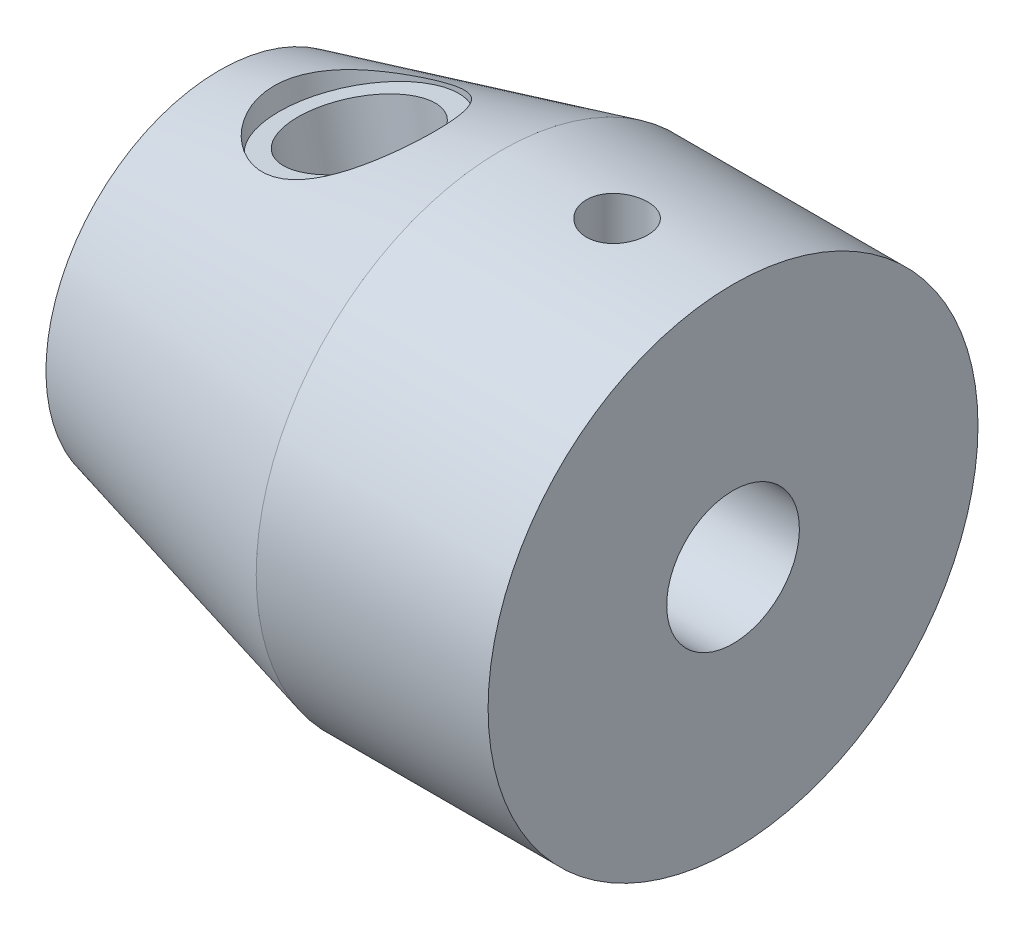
ISO-10303-21;
HEADER;
FILE_DESCRIPTION(('STEP AP214'),'2;1');
FILE_NAME('part.step','',(''),(''),'','','');
FILE_SCHEMA(('AUTOMOTIVE_DESIGN { 1 0 10303 214 1 1 1 1 }'));
ENDSEC;
DATA;
#1=APPLICATION_CONTEXT('core data for automotive mechanical design processes');
#2=APPLICATION_PROTOCOL_DEFINITION('international standard','automotive_design',2000,#1);
#3=PRODUCT_CONTEXT('',#1,'mechanical');
#4=PRODUCT('Part','Part','',(#3));
#5=PRODUCT_RELATED_PRODUCT_CATEGORY('part','',(#4));
#6=PRODUCT_DEFINITION_FORMATION('','',#4);
#7=PRODUCT_DEFINITION_CONTEXT('part definition',#1,'design');
#8=PRODUCT_DEFINITION('design','',#6,#7);
#9=PRODUCT_DEFINITION_SHAPE('','',#8);
#10=(LENGTH_UNIT() NAMED_UNIT(*) SI_UNIT(.MILLI.,.METRE.));
#11=(NAMED_UNIT(*) PLANE_ANGLE_UNIT() SI_UNIT($,.RADIAN.));
#12=(NAMED_UNIT(*) SI_UNIT($,.STERADIAN.) SOLID_ANGLE_UNIT());
#13=UNCERTAINTY_MEASURE_WITH_UNIT(LENGTH_MEASURE(1.E-05),#10,'distance_accuracy_value','');
#14=(GEOMETRIC_REPRESENTATION_CONTEXT(3) GLOBAL_UNCERTAINTY_ASSIGNED_CONTEXT((#13)) GLOBAL_UNIT_ASSIGNED_CONTEXT((#10,
#11,#12)) REPRESENTATION_CONTEXT('',''));
#15=CARTESIAN_POINT('',(0.,0.,0.));
#16=DIRECTION('',(0.,0.,1.));
#17=DIRECTION('',(1.,0.,0.));
#18=AXIS2_PLACEMENT_3D('',#15,#16,#17);
#19=CARTESIAN_POINT('',(0.,0.,0.));
#20=DIRECTION('',(-1.,0.,0.));
#21=DIRECTION('',(0.,-1.,0.));
#22=AXIS2_PLACEMENT_3D('',#19,#20,#21);
#23=PLANE('',#22);
#24=CARTESIAN_POINT('',(0.,0.,0.));
#25=DIRECTION('',(1.,0.,0.));
#26=DIRECTION('',(0.,1.,0.));
#27=AXIS2_PLACEMENT_3D('',#24,#25,#26);
#28=CIRCLE('',#27,8.5);
#29=CARTESIAN_POINT('',(0.,8.5,0.));
#30=VERTEX_POINT('',#29);
#31=EDGE_CURVE('E45',#30,#30,#28,.T.);
#32=ORIENTED_EDGE('',*,*,#31,.F.);
#33=EDGE_LOOP('',(#32));
#34=FACE_BOUND('',#33,.T.);
#35=ADVANCED_FACE('F34',(#34),#23,.T.);
#36=CARTESIAN_POINT('',(13.8,0.,0.));
#37=DIRECTION('',(1.,0.,0.));
#38=DIRECTION('',(0.,1.,0.));
#39=AXIS2_PLACEMENT_3D('',#36,#37,#38);
#40=CONICAL_SURFACE('',#39,12.,0.24838580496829);
#41=CARTESIAN_POINT('',(3.87981151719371,9.05597758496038,-2.81704079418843));
#42=CARTESIAN_POINT('',(3.71724085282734,9.06299686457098,-2.65565465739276));
#43=CARTESIAN_POINT('',(3.56742265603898,9.07344776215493,-2.48110509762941));
#44=CARTESIAN_POINT('',(3.29821789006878,9.09690122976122,-2.10955991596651));
#45=CARTESIAN_POINT('',(3.17890691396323,9.10990999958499,-1.91251025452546));
#46=CARTESIAN_POINT('',(2.9753832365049,9.13450488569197,-1.50029593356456));
#47=CARTESIAN_POINT('',(2.89124475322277,9.14608795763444,-1.28509410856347));
#48=CARTESIAN_POINT('',(2.76258006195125,9.16458809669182,-0.843127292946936));
#49=CARTESIAN_POINT('',(2.71800909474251,9.1715104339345,-0.6163756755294));
#50=CARTESIAN_POINT('',(2.67208854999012,9.17866377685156,-0.170976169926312));
#51=CARTESIAN_POINT('',(2.66850963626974,9.17923985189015,0.0474371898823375));
#52=CARTESIAN_POINT('',(2.69899754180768,9.17446270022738,0.48155440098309));
#53=CARTESIAN_POINT('',(2.73306542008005,9.16910930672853,0.697258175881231));
#54=CARTESIAN_POINT('',(2.83540883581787,9.15400716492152,1.11272009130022));
#55=CARTESIAN_POINT('',(2.90254169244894,9.14440626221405,1.31276835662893));
#56=CARTESIAN_POINT('',(3.0675919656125,9.12305271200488,1.69957684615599));
#57=CARTESIAN_POINT('',(3.16551634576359,9.11129957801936,1.88633405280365));
#58=CARTESIAN_POINT('',(3.39509182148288,9.08787088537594,2.25278362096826));
#59=CARTESIAN_POINT('',(3.52833688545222,9.07623729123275,2.43147938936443));
#60=CARTESIAN_POINT('',(3.82121317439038,9.05761595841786,2.76606600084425));
#61=CARTESIAN_POINT('',(3.98085716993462,9.05063047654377,2.92194573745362));
#62=CARTESIAN_POINT('',(4.33325650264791,9.04516785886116,3.21668173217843));
#63=CARTESIAN_POINT('',(4.52747139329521,9.04725968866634,3.35382642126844));
#64=CARTESIAN_POINT('',(4.83300015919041,9.06106732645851,3.53418062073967));
#65=CARTESIAN_POINT('',(4.93726149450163,9.06745352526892,3.59009120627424));
#66=CARTESIAN_POINT('',(5.14976288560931,9.08423287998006,3.69300621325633));
#67=CARTESIAN_POINT('',(5.25800099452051,9.0946240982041,3.74001492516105));
#68=CARTESIAN_POINT('',(5.47437621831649,9.11940288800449,3.82343047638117));
#69=CARTESIAN_POINT('',(5.58242399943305,9.13366491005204,3.86010680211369));
#70=CARTESIAN_POINT('',(5.80053438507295,9.16649421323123,3.92425168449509));
#71=CARTESIAN_POINT('',(5.91059606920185,9.18505957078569,3.9517243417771));
#72=CARTESIAN_POINT('',(6.13182695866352,9.22655059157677,3.99717884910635));
#73=CARTESIAN_POINT('',(6.24299590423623,9.24947525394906,4.01516287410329));
#74=CARTESIAN_POINT('',(6.46551326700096,9.29958502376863,4.04145387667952));
#75=CARTESIAN_POINT('',(6.57686167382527,9.3267698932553,4.04976139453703));
#76=CARTESIAN_POINT('',(6.79077523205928,9.38303220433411,4.05637092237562));
#77=CARTESIAN_POINT('',(6.89339306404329,9.41183047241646,4.05535326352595));
#78=CARTESIAN_POINT('',(7.09728088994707,9.47255442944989,4.04496020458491));
#79=CARTESIAN_POINT('',(7.19855042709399,9.50448114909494,4.03558204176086));
#80=CARTESIAN_POINT('',(7.49926138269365,9.60435828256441,3.99503258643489));
#81=CARTESIAN_POINT('',(7.69580218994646,9.67645819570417,3.95145210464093));
#82=CARTESIAN_POINT('',(8.07745386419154,9.82816525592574,3.83244987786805));
#83=CARTESIAN_POINT('',(8.26247452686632,9.90782167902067,3.75680613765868));
#84=CARTESIAN_POINT('',(8.6162434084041,10.0697667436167,3.57598784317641));
#85=CARTESIAN_POINT('',(8.78498680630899,10.1520561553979,3.47080457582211));
#86=CARTESIAN_POINT('',(9.11410597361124,10.3202368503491,3.22551861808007));
#87=CARTESIAN_POINT('',(9.27315312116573,10.4059975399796,3.08354145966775));
#88=CARTESIAN_POINT('',(9.56658575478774,10.5701342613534,2.77236637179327));
#89=CARTESIAN_POINT('',(9.70096510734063,10.6485084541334,2.60316169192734));
#90=CARTESIAN_POINT('',(9.94599575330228,10.7952035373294,2.2358705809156));
#91=CARTESIAN_POINT('',(10.0557888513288,10.863140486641,2.03705516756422));
#92=CARTESIAN_POINT('',(10.2432472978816,10.9811720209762,1.61992196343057));
#93=CARTESIAN_POINT('',(10.3209215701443,11.0312715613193,1.40160961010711));
#94=CARTESIAN_POINT('',(10.4394226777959,11.1084046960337,0.960296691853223));
#95=CARTESIAN_POINT('',(10.4815177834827,11.1362301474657,0.737776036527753));
#96=CARTESIAN_POINT('',(10.5322067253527,11.1697945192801,0.287339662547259));
#97=CARTESIAN_POINT('',(10.540811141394,11.1755404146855,0.0594256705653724));
#98=CARTESIAN_POINT('',(10.5246236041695,11.164786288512,-0.384048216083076));
#99=CARTESIAN_POINT('',(10.5013603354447,11.149304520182,-0.59969129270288));
#100=CARTESIAN_POINT('',(10.4248824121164,11.0989609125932,-1.02323996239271));
#101=CARTESIAN_POINT('',(10.3716673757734,11.0640988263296,-1.23114545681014));
#102=CARTESIAN_POINT('',(10.2365525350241,10.9770993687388,-1.63464828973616));
#103=CARTESIAN_POINT('',(10.154521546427,10.9248830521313,-1.83018442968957));
#104=CARTESIAN_POINT('',(9.9639223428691,10.8064781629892,-2.20325303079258));
#105=CARTESIAN_POINT('',(9.85534776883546,10.7402862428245,-2.38078116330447));
#106=CARTESIAN_POINT('',(9.60804004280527,10.5943003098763,-2.72212664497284));
#107=CARTESIAN_POINT('',(9.46808922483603,10.5139985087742,-2.88484499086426));
#108=CARTESIAN_POINT('',(9.16424882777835,10.3471928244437,-3.18245150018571));
#109=CARTESIAN_POINT('',(9.00035123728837,10.2606868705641,-3.31733031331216));
#110=CARTESIAN_POINT('',(8.6456190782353,10.0837823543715,-3.55992005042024));
#111=CARTESIAN_POINT('',(8.45405697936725,9.99335158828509,-3.66654872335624));
#112=CARTESIAN_POINT('',(8.05247215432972,9.81758304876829,-3.84291511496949));
#113=CARTESIAN_POINT('',(7.84245517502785,9.73224370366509,-3.9126642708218));
#114=CARTESIAN_POINT('',(7.41707297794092,9.5754109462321,-4.01062285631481));
#115=CARTESIAN_POINT('',(7.20218158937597,9.50352628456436,-4.04025348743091));
#116=CARTESIAN_POINT('',(6.7663272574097,9.37427069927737,-4.06115720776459));
#117=CARTESIAN_POINT('',(6.54536832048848,9.31689044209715,-4.052455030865));
#118=CARTESIAN_POINT('',(6.1188866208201,9.22225399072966,-3.99881817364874));
#119=CARTESIAN_POINT('',(5.9132935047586,9.18393269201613,-3.95627381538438));
#120=CARTESIAN_POINT('',(5.5088658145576,9.12216959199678,-3.83950852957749));
#121=CARTESIAN_POINT('',(5.31003609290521,9.09873826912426,-3.76526535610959));
#122=CARTESIAN_POINT('',(4.92264117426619,9.06502447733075,-3.58669489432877));
#123=CARTESIAN_POINT('',(4.73421263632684,9.0548891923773,-3.48204626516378));
#124=CARTESIAN_POINT('',(4.37500317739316,9.04538933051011,-3.24609810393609));
#125=CARTESIAN_POINT('',(4.20418746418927,9.04600309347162,-3.11485269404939));
#126=CARTESIAN_POINT('',(3.98809153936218,9.0517328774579,-2.92174041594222));
#127=CARTESIAN_POINT('',(3.93326226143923,9.05366975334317,-2.87010208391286));
#128=CARTESIAN_POINT('',(3.87981151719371,9.05597758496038,-2.81704079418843));
#129=B_SPLINE_CURVE_WITH_KNOTS('',3,(#41,#42,#43,#44,#45,#46,#47,#48,#49,#50,#51,#52,#53,#54,
#55,#56,#57,#58,#59,#60,#61,#62,#63,#64,#65,#66,#67,#68,#69,#70,#71,#72,#73,#74,#75,#76,#77,#78,
#79,#80,#81,#82,#83,#84,#85,#86,#87,#88,#89,#90,#91,#92,#93,#94,#95,#96,#97,#98,#99,#100,#101,
#102,#103,#104,#105,#106,#107,#108,#109,#110,#111,#112,#113,#114,#115,#116,#117,#118,#119,#120,
#121,#122,#123,#124,#125,#126,#127,#128),.UNSPECIFIED.,.T.,.F.,(4,2,2,2,2,2,2,2,2,2,2,2,2,2,2,2,
2,2,2,2,2,2,2,2,2,2,2,2,2,2,2,2,2,2,2,2,2,2,2,2,2,2,2,4),(0.,0.687348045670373,1.37638310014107,
2.06686484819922,2.75656451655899,3.4085648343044,4.06058349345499,4.69150200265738,
5.32256329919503,5.9893076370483,6.65637546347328,7.36583890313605,7.72089385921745,
8.07577725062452,8.42029835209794,8.764665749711,9.10895417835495,9.45322338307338,
9.77258789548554,10.0920579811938,10.7303938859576,11.3732235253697,12.0162429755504,
12.7025623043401,13.3890520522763,14.0966834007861,14.8041180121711,15.4851213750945,
16.1659095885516,16.8151589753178,17.4644166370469,18.1166691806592,18.7690781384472,
19.4534746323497,20.1381006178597,20.8460532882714,21.553786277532,22.2357273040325,
22.9172283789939,23.5544602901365,24.1921401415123,24.8368210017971,25.4802029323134,
25.7061924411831),.UNSPECIFIED.);
#130=CARTESIAN_POINT('',(3.87981151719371,9.05597758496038,-2.81704079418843));
#131=VERTEX_POINT('',#130);
#132=EDGE_CURVE('E10',#131,#131,#129,.T.);
#133=ORIENTED_EDGE('',*,*,#132,.F.);
#134=EDGE_LOOP('',(#133));
#135=FACE_BOUND('',#134,.T.);
#136=ORIENTED_EDGE('',*,*,#31,.T.);
#137=EDGE_LOOP('',(#136));
#138=FACE_BOUND('',#137,.T.);
#139=CARTESIAN_POINT('',(13.8,0.,0.));
#140=DIRECTION('',(1.,0.,0.));
#141=DIRECTION('',(0.,1.,0.));
#142=AXIS2_PLACEMENT_3D('',#139,#140,#141);
#143=CIRCLE('',#142,12.);
#144=CARTESIAN_POINT('',(13.8,12.,0.));
#145=VERTEX_POINT('',#144);
#146=EDGE_CURVE('E50',#145,#145,#143,.T.);
#147=ORIENTED_EDGE('',*,*,#146,.F.);
#148=EDGE_LOOP('',(#147));
#149=FACE_BOUND('',#148,.T.);
#150=ADVANCED_FACE('F60',(#135,#138,#149),#40,.T.);
#151=CARTESIAN_POINT('',(25.16,0.,0.));
#152=DIRECTION('',(1.,0.,0.));
#153=DIRECTION('',(0.,1.,0.));
#154=AXIS2_PLACEMENT_3D('',#151,#152,#153);
#155=CYLINDRICAL_SURFACE('',#154,12.);
#156=CARTESIAN_POINT('',(17.98,-12.,0.));
#157=CARTESIAN_POINT('',(17.9800035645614,-11.9999988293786,-0.0839046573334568));
#158=CARTESIAN_POINT('',(17.9870637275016,-11.9991107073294,-0.167861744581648));
#159=CARTESIAN_POINT('',(18.0151166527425,-11.9956532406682,-0.333439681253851));
#160=CARTESIAN_POINT('',(18.036123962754,-11.9930821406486,-0.415057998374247));
#161=CARTESIAN_POINT('',(18.0914425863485,-11.9865483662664,-0.573537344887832));
#162=CARTESIAN_POINT('',(18.1257449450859,-11.9825866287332,-0.650401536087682));
#163=CARTESIAN_POINT('',(18.2066603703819,-11.9737122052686,-0.797267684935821));
#164=CARTESIAN_POINT('',(18.2532713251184,-11.9687996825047,-0.867270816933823));
#165=CARTESIAN_POINT('',(18.3577551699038,-11.958541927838,-0.998827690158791));
#166=CARTESIAN_POINT('',(18.4156822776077,-11.9531946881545,-1.06033821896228));
#167=CARTESIAN_POINT('',(18.541037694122,-11.9426863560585,-1.1727916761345));
#168=CARTESIAN_POINT('',(18.608466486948,-11.9375252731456,-1.22373406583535));
#169=CARTESIAN_POINT('',(18.7511919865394,-11.9279538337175,-1.31376609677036));
#170=CARTESIAN_POINT('',(18.8265144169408,-11.9235460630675,-1.35281525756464));
#171=CARTESIAN_POINT('',(18.9827122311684,-11.9160067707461,-1.41769384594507));
#172=CARTESIAN_POINT('',(19.0635874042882,-11.9128752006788,-1.44352377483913));
#173=CARTESIAN_POINT('',(19.2281465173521,-11.9082620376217,-1.48109938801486));
#174=CARTESIAN_POINT('',(19.3118135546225,-11.9067719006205,-1.49291802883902));
#175=CARTESIAN_POINT('',(19.4799557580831,-11.9055841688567,-1.50236132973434));
#176=CARTESIAN_POINT('',(19.5644308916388,-11.905886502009,-1.49998656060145));
#177=CARTESIAN_POINT('',(19.7312828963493,-11.9082417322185,-1.48117034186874));
#178=CARTESIAN_POINT('',(19.8136689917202,-11.910284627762,-1.46480925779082));
#179=CARTESIAN_POINT('',(19.9745170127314,-11.9158751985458,-1.41861022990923));
#180=CARTESIAN_POINT('',(20.0529788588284,-11.9194229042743,-1.38877201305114));
#181=CARTESIAN_POINT('',(20.204000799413,-11.9276346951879,-1.31637933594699));
#182=CARTESIAN_POINT('',(20.2765439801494,-11.9323018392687,-1.27378995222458));
#183=CARTESIAN_POINT('',(20.413484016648,-11.9422242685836,-1.17712888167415));
#184=CARTESIAN_POINT('',(20.4778804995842,-11.947479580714,-1.12305666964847));
#185=CARTESIAN_POINT('',(20.5971656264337,-11.9580306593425,-1.00451946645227));
#186=CARTESIAN_POINT('',(20.6519854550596,-11.9633264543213,-0.939985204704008));
#187=CARTESIAN_POINT('',(20.7500253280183,-11.9733277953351,-0.802594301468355));
#188=CARTESIAN_POINT('',(20.7932453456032,-11.978033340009,-0.729737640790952));
#189=CARTESIAN_POINT('',(20.8668587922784,-11.9863269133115,-0.577717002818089));
#190=CARTESIAN_POINT('',(20.8972479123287,-11.9899145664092,-0.49855091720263));
#191=CARTESIAN_POINT('',(20.944282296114,-11.9955647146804,-0.336184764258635));
#192=CARTESIAN_POINT('',(20.9609282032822,-11.9976272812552,-0.252984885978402));
#193=CARTESIAN_POINT('',(20.9799144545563,-11.9999855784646,-0.0855078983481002));
#194=CARTESIAN_POINT('',(20.9823495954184,-12.0002930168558,-0.00124169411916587));
#195=CARTESIAN_POINT('',(20.9730953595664,-11.9991380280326,0.166497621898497));
#196=CARTESIAN_POINT('',(20.9614062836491,-11.9976756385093,0.249970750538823));
#197=CARTESIAN_POINT('',(20.9243141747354,-11.9931526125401,0.413474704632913));
#198=CARTESIAN_POINT('',(20.8989563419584,-11.9900972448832,0.493515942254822));
#199=CARTESIAN_POINT('',(20.8352935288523,-11.9827303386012,0.648209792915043));
#200=CARTESIAN_POINT('',(20.7969881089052,-11.9784187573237,0.722862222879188));
#201=CARTESIAN_POINT('',(20.7082881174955,-11.9689909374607,0.865082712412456));
#202=CARTESIAN_POINT('',(20.6578322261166,-11.963870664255,0.932612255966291));
#203=CARTESIAN_POINT('',(20.5463503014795,-11.9534108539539,1.05827819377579));
#204=CARTESIAN_POINT('',(20.4853238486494,-11.9480713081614,1.11641421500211));
#205=CARTESIAN_POINT('',(20.3540155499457,-11.9377386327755,1.22197917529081));
#206=CARTESIAN_POINT('',(20.2836829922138,-11.932747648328,1.26934527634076));
#207=CARTESIAN_POINT('',(20.1360050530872,-11.9237124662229,1.3515917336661));
#208=CARTESIAN_POINT('',(20.0586598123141,-11.9196682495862,1.38647234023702));
#209=CARTESIAN_POINT('',(19.8993548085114,-11.912999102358,1.44265594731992));
#210=CARTESIAN_POINT('',(19.8174077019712,-11.9103704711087,1.46399437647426));
#211=CARTESIAN_POINT('',(19.6510585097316,-11.9068194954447,1.49260199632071));
#212=CARTESIAN_POINT('',(19.5666565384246,-11.9058970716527,1.49987184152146));
#213=CARTESIAN_POINT('',(19.3984186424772,-11.9058652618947,1.5001239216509));
#214=CARTESIAN_POINT('',(19.3145828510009,-11.9067433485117,1.49320487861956));
#215=CARTESIAN_POINT('',(19.149275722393,-11.9101866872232,1.4654846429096));
#216=CARTESIAN_POINT('',(19.0678043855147,-11.9127519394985,1.44468344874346));
#217=CARTESIAN_POINT('',(18.9095518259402,-11.9192766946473,1.38982024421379));
#218=CARTESIAN_POINT('',(18.8327689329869,-11.9232356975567,1.35576298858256));
#219=CARTESIAN_POINT('',(18.685992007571,-11.9321026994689,1.27536414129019));
#220=CARTESIAN_POINT('',(18.6159980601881,-11.9370107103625,1.22902239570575));
#221=CARTESIAN_POINT('',(18.4842812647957,-11.9472636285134,1.1250037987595));
#222=CARTESIAN_POINT('',(18.422616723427,-11.9526112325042,1.06725337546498));
#223=CARTESIAN_POINT('',(18.3098159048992,-11.9631169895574,0.94221013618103));
#224=CARTESIAN_POINT('',(18.2586821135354,-11.9682750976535,0.874915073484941));
#225=CARTESIAN_POINT('',(18.1682287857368,-11.9778423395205,0.732399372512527));
#226=CARTESIAN_POINT('',(18.1289549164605,-11.9822485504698,0.657149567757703));
#227=CARTESIAN_POINT('',(18.0636572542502,-11.9897858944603,0.50110974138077));
#228=CARTESIAN_POINT('',(18.0376190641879,-11.9929184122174,0.420325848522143));
#229=CARTESIAN_POINT('',(18.0057643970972,-11.9968003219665,0.282603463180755));
#230=CARTESIAN_POINT('',(17.9961166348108,-11.9979943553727,0.226533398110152));
#231=CARTESIAN_POINT('',(17.9832332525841,-11.9995945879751,0.11365023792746));
#232=CARTESIAN_POINT('',(17.9799975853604,-12.0000007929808,0.0568371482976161));
#233=CARTESIAN_POINT('',(17.98,-12.,0.));
#234=B_SPLINE_CURVE_WITH_KNOTS('',3,(#156,#157,#158,#159,#160,#161,#162,#163,#164,#165,#166,
#167,#168,#169,#170,#171,#172,#173,#174,#175,#176,#177,#178,#179,#180,#181,#182,#183,#184,#185,
#186,#187,#188,#189,#190,#191,#192,#193,#194,#195,#196,#197,#198,#199,#200,#201,#202,#203,#204,
#205,#206,#207,#208,#209,#210,#211,#212,#213,#214,#215,#216,#217,#218,#219,#220,#221,#222,#223,
#224,#225,#226,#227,#228,#229,#230,#231,#232,#233),.UNSPECIFIED.,.T.,.F.,(4,2,2,2,2,2,2,2,2,2,2,
2,2,2,2,2,2,2,2,2,2,2,2,2,2,2,2,2,2,2,2,2,2,2,2,2,2,2,4),(0.,0.251506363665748,
0.503275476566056,0.754875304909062,1.00643199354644,1.25922487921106,1.51203064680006,
1.76568750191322,2.01933473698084,2.27165535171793,2.52396581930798,2.77483617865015,
3.02571162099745,3.2772805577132,3.52886100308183,3.7821808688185,4.03550131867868,
4.28890677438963,4.54230036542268,4.79400167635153,5.04569762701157,5.29656632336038,
5.54744353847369,5.79961441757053,6.05179530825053,6.30541182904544,6.55902326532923,
6.81196844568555,7.06490185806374,7.31608140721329,7.56726098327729,7.81835054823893,
8.06944325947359,8.32221142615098,8.57503919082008,8.82882841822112,9.0823409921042,
9.25271305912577,9.42308386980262),.UNSPECIFIED.);
#235=CARTESIAN_POINT('',(17.98,-12.,0.));
#236=VERTEX_POINT('',#235);
#237=EDGE_CURVE('E100',#236,#236,#234,.T.);
#238=ORIENTED_EDGE('',*,*,#237,.F.);
#239=EDGE_LOOP('',(#238));
#240=FACE_BOUND('',#239,.T.);
#241=CARTESIAN_POINT('',(17.98,12.,0.));
#242=CARTESIAN_POINT('',(17.9800035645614,11.9999988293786,0.0839046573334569));
#243=CARTESIAN_POINT('',(17.9870637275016,11.9991107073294,0.167861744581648));
#244=CARTESIAN_POINT('',(18.0151166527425,11.9956532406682,0.333439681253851));
#245=CARTESIAN_POINT('',(18.036123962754,11.9930821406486,0.415057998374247));
#246=CARTESIAN_POINT('',(18.0914425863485,11.9865483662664,0.573537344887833));
#247=CARTESIAN_POINT('',(18.1257449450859,11.9825866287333,0.650401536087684));
#248=CARTESIAN_POINT('',(18.2066603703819,11.9737122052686,0.797267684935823));
#249=CARTESIAN_POINT('',(18.2532713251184,11.9687996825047,0.867270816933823));
#250=CARTESIAN_POINT('',(18.3577551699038,11.958541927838,0.998827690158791));
#251=CARTESIAN_POINT('',(18.4156822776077,11.9531946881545,1.06033821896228));
#252=CARTESIAN_POINT('',(18.541037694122,11.9426863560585,1.1727916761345));
#253=CARTESIAN_POINT('',(18.608466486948,11.9375252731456,1.22373406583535));
#254=CARTESIAN_POINT('',(18.7511919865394,11.9279538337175,1.31376609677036));
#255=CARTESIAN_POINT('',(18.8265144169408,11.9235460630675,1.35281525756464));
#256=CARTESIAN_POINT('',(18.9827122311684,11.9160067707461,1.41769384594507));
#257=CARTESIAN_POINT('',(19.0635874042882,11.9128752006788,1.44352377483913));
#258=CARTESIAN_POINT('',(19.2281465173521,11.9082620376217,1.48109938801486));
#259=CARTESIAN_POINT('',(19.3118135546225,11.9067719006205,1.49291802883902));
#260=CARTESIAN_POINT('',(19.4799557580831,11.9055841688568,1.50236132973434));
#261=CARTESIAN_POINT('',(19.5644308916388,11.9058865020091,1.49998656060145));
#262=CARTESIAN_POINT('',(19.7312828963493,11.9082417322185,1.48117034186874));
#263=CARTESIAN_POINT('',(19.8136689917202,11.910284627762,1.46480925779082));
#264=CARTESIAN_POINT('',(19.9745170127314,11.9158751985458,1.41861022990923));
#265=CARTESIAN_POINT('',(20.0529788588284,11.9194229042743,1.38877201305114));
#266=CARTESIAN_POINT('',(20.204000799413,11.9276346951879,1.31637933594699));
#267=CARTESIAN_POINT('',(20.2765439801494,11.9323018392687,1.27378995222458));
#268=CARTESIAN_POINT('',(20.413484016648,11.9422242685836,1.17712888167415));
#269=CARTESIAN_POINT('',(20.4778804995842,11.947479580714,1.12305666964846));
#270=CARTESIAN_POINT('',(20.5971656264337,11.9580306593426,1.00451946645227));
#271=CARTESIAN_POINT('',(20.6519854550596,11.9633264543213,0.939985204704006));
#272=CARTESIAN_POINT('',(20.7500253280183,11.9733277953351,0.802594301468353));
#273=CARTESIAN_POINT('',(20.7932453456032,11.978033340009,0.72973764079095));
#274=CARTESIAN_POINT('',(20.8668587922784,11.9863269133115,0.577717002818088));
#275=CARTESIAN_POINT('',(20.8972479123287,11.9899145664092,0.498550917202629));
#276=CARTESIAN_POINT('',(20.944282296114,11.9955647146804,0.336184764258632));
#277=CARTESIAN_POINT('',(20.9609282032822,11.9976272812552,0.252984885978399));
#278=CARTESIAN_POINT('',(20.9799144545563,11.9999855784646,0.085507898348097));
#279=CARTESIAN_POINT('',(20.9823495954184,12.0002930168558,0.00124169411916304));
#280=CARTESIAN_POINT('',(20.9730953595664,11.9991380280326,-0.166497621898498));
#281=CARTESIAN_POINT('',(20.961406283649,11.9976756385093,-0.249970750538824));
#282=CARTESIAN_POINT('',(20.9243141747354,11.9931526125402,-0.413474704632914));
#283=CARTESIAN_POINT('',(20.8989563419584,11.9900972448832,-0.493515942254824));
#284=CARTESIAN_POINT('',(20.8352935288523,11.9827303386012,-0.648209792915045));
#285=CARTESIAN_POINT('',(20.7969881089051,11.9784187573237,-0.722862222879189));
#286=CARTESIAN_POINT('',(20.7082881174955,11.9689909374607,-0.865082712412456));
#287=CARTESIAN_POINT('',(20.6578322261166,11.9638706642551,-0.932612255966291));
#288=CARTESIAN_POINT('',(20.5463503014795,11.9534108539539,-1.05827819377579));
#289=CARTESIAN_POINT('',(20.4853238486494,11.9480713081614,-1.11641421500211));
#290=CARTESIAN_POINT('',(20.3540155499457,11.9377386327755,-1.22197917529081));
#291=CARTESIAN_POINT('',(20.2836829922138,11.932747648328,-1.26934527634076));
#292=CARTESIAN_POINT('',(20.1360050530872,11.9237124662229,-1.3515917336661));
#293=CARTESIAN_POINT('',(20.0586598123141,11.9196682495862,-1.38647234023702));
#294=CARTESIAN_POINT('',(19.8993548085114,11.912999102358,-1.44265594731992));
#295=CARTESIAN_POINT('',(19.8174077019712,11.9103704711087,-1.46399437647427));
#296=CARTESIAN_POINT('',(19.6510585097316,11.9068194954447,-1.49260199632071));
#297=CARTESIAN_POINT('',(19.5666565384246,11.9058970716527,-1.49987184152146));
#298=CARTESIAN_POINT('',(19.3984186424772,11.9058652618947,-1.5001239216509));
#299=CARTESIAN_POINT('',(19.3145828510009,11.9067433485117,-1.49320487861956));
#300=CARTESIAN_POINT('',(19.149275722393,11.9101866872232,-1.4654846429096));
#301=CARTESIAN_POINT('',(19.0678043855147,11.9127519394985,-1.44468344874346));
#302=CARTESIAN_POINT('',(18.9095518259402,11.9192766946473,-1.38982024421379));
#303=CARTESIAN_POINT('',(18.8327689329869,11.9232356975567,-1.35576298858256));
#304=CARTESIAN_POINT('',(18.685992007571,11.9321026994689,-1.27536414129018));
#305=CARTESIAN_POINT('',(18.6159980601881,11.9370107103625,-1.22902239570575));
#306=CARTESIAN_POINT('',(18.4842812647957,11.9472636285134,-1.1250037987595));
#307=CARTESIAN_POINT('',(18.422616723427,11.9526112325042,-1.06725337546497));
#308=CARTESIAN_POINT('',(18.3098159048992,11.9631169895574,-0.942210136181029));
#309=CARTESIAN_POINT('',(18.2586821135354,11.9682750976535,-0.87491507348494));
#310=CARTESIAN_POINT('',(18.1682287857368,11.9778423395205,-0.732399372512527));
#311=CARTESIAN_POINT('',(18.1289549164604,11.9822485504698,-0.657149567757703));
#312=CARTESIAN_POINT('',(18.0636572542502,11.9897858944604,-0.501109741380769));
#313=CARTESIAN_POINT('',(18.0376190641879,11.9929184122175,-0.420325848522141));
#314=CARTESIAN_POINT('',(18.0057643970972,11.9968003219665,-0.282603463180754));
#315=CARTESIAN_POINT('',(17.9961166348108,11.9979943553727,-0.226533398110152));
#316=CARTESIAN_POINT('',(17.9832332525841,11.9995945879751,-0.11365023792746));
#317=CARTESIAN_POINT('',(17.9799975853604,12.0000007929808,-0.0568371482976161));
#318=CARTESIAN_POINT('',(17.98,12.,0.));
#319=B_SPLINE_CURVE_WITH_KNOTS('',3,(#241,#242,#243,#244,#245,#246,#247,#248,#249,#250,#251,
#252,#253,#254,#255,#256,#257,#258,#259,#260,#261,#262,#263,#264,#265,#266,#267,#268,#269,#270,
#271,#272,#273,#274,#275,#276,#277,#278,#279,#280,#281,#282,#283,#284,#285,#286,#287,#288,#289,
#290,#291,#292,#293,#294,#295,#296,#297,#298,#299,#300,#301,#302,#303,#304,#305,#306,#307,#308,
#309,#310,#311,#312,#313,#314,#315,#316,#317,#318),.UNSPECIFIED.,.T.,.F.,(4,2,2,2,2,2,2,2,2,2,2,
2,2,2,2,2,2,2,2,2,2,2,2,2,2,2,2,2,2,2,2,2,2,2,2,2,2,2,4),(0.,0.251506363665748,
0.503275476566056,0.754875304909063,1.00643199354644,1.25922487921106,1.51203064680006,
1.76568750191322,2.01933473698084,2.27165535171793,2.52396581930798,2.77483617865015,
3.02571162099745,3.2772805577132,3.52886100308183,3.7821808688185,4.03550131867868,
4.28890677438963,4.54230036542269,4.79400167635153,5.04569762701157,5.29656632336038,
5.54744353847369,5.79961441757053,6.05179530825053,6.30541182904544,6.55902326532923,
6.81196844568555,7.06490185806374,7.31608140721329,7.56726098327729,7.81835054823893,
8.06944325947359,8.32221142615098,8.57503919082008,8.82882841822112,9.0823409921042,
9.25271305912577,9.42308386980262),.UNSPECIFIED.);
#320=CARTESIAN_POINT('',(17.98,12.,0.));
#321=VERTEX_POINT('',#320);
#322=EDGE_CURVE('E96',#321,#321,#319,.T.);
#323=ORIENTED_EDGE('',*,*,#322,.F.);
#324=EDGE_LOOP('',(#323));
#325=FACE_BOUND('',#324,.T.);
#326=ORIENTED_EDGE('',*,*,#146,.T.);
#327=EDGE_LOOP('',(#326));
#328=FACE_BOUND('',#327,.T.);
#329=CARTESIAN_POINT('',(25.16,0.,0.));
#330=DIRECTION('',(1.,0.,0.));
#331=DIRECTION('',(0.,1.,0.));
#332=AXIS2_PLACEMENT_3D('',#329,#330,#331);
#333=CIRCLE('',#332,12.);
#334=CARTESIAN_POINT('',(25.16,12.,0.));
#335=VERTEX_POINT('',#334);
#336=EDGE_CURVE('E133',#335,#335,#333,.T.);
#337=ORIENTED_EDGE('',*,*,#336,.F.);
#338=EDGE_LOOP('',(#337));
#339=FACE_BOUND('',#338,.T.);
#340=ADVANCED_FACE('F89',(#240,#325,#328,#339),#155,.T.);
#341=CARTESIAN_POINT('',(25.16,12.,0.));
#342=DIRECTION('',(1.,0.,0.));
#343=DIRECTION('',(0.,1.,0.));
#344=AXIS2_PLACEMENT_3D('',#341,#342,#343);
#345=PLANE('',#344);
#346=CARTESIAN_POINT('',(25.16,0.,0.));
#347=DIRECTION('',(1.,0.,0.));
#348=DIRECTION('',(0.,1.,0.));
#349=AXIS2_PLACEMENT_3D('',#346,#347,#348);
#350=CIRCLE('',#349,3.25);
#351=CARTESIAN_POINT('',(25.16,3.25,0.));
#352=VERTEX_POINT('',#351);
#353=EDGE_CURVE('E139',#352,#352,#350,.T.);
#354=ORIENTED_EDGE('',*,*,#353,.F.);
#355=EDGE_LOOP('',(#354));
#356=FACE_BOUND('',#355,.T.);
#357=ORIENTED_EDGE('',*,*,#336,.T.);
#358=EDGE_LOOP('',(#357));
#359=FACE_BOUND('',#358,.T.);
#360=ADVANCED_FACE('F85',(#356,#359),#345,.T.);
#361=CARTESIAN_POINT('',(15.16,0.,0.));
#362=DIRECTION('',(1.,0.,0.));
#363=DIRECTION('',(0.,1.,0.));
#364=AXIS2_PLACEMENT_3D('',#361,#362,#363);
#365=CYLINDRICAL_SURFACE('',#364,3.25);
#366=CARTESIAN_POINT('',(17.98,3.25,0.));
#367=CARTESIAN_POINT('',(17.980004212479,3.24999648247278,0.0795665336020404));
#368=CARTESIAN_POINT('',(17.9863681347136,3.24704578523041,0.159248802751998));
#369=CARTESIAN_POINT('',(18.0115631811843,3.23553478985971,0.316302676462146));
#370=CARTESIAN_POINT('',(18.0304224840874,3.22696181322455,0.393668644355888));
#371=CARTESIAN_POINT('',(18.0797386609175,3.2051126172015,0.543571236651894));
#372=CARTESIAN_POINT('',(18.110152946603,3.19185368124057,0.616124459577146));
#373=CARTESIAN_POINT('',(18.1815168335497,3.16188428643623,0.755011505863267));
#374=CARTESIAN_POINT('',(18.2224645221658,3.14517445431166,0.821346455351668));
#375=CARTESIAN_POINT('',(18.3162587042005,3.10883035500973,0.949934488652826));
#376=CARTESIAN_POINT('',(18.3696269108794,3.08908710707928,1.01177584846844));
#377=CARTESIAN_POINT('',(18.4856356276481,3.04931006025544,1.12599874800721));
#378=CARTESIAN_POINT('',(18.5482820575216,3.02927608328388,1.17837420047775));
#379=CARTESIAN_POINT('',(18.6858609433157,2.98974101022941,1.27548887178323));
#380=CARTESIAN_POINT('',(18.7613206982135,2.97035435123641,1.31953284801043));
#381=CARTESIAN_POINT('',(18.9195867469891,2.93608939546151,1.39412192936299));
#382=CARTESIAN_POINT('',(19.0023884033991,2.92120827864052,1.42467548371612));
#383=CARTESIAN_POINT('',(19.1682754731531,2.89884571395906,1.46962454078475));
#384=CARTESIAN_POINT('',(19.2510936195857,2.8910015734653,1.4848179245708));
#385=CARTESIAN_POINT('',(19.4184457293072,2.88259066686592,1.50108773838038));
#386=CARTESIAN_POINT('',(19.5029783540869,2.88201842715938,1.50217478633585));
#387=CARTESIAN_POINT('',(19.6624743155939,2.88791642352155,1.49079280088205));
#388=CARTESIAN_POINT('',(19.7375627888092,2.89370119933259,1.47964335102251));
#389=CARTESIAN_POINT('',(19.8846511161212,2.91048067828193,1.44635609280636));
#390=CARTESIAN_POINT('',(19.9566501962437,2.92147667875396,1.42421554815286));
#391=CARTESIAN_POINT('',(20.0975042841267,2.94769456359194,1.36913890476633));
#392=CARTESIAN_POINT('',(20.1662492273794,2.96300763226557,1.33596673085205));
#393=CARTESIAN_POINT('',(20.2975007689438,2.99612519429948,1.2599408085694));
#394=CARTESIAN_POINT('',(20.3600046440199,3.01393076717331,1.21708286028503));
#395=CARTESIAN_POINT('',(20.4839704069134,3.0523140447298,1.11759089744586));
#396=CARTESIAN_POINT('',(20.5446205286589,3.07298560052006,1.05997849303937));
#397=CARTESIAN_POINT('',(20.6557055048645,3.1132136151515,0.935250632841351));
#398=CARTESIAN_POINT('',(20.7061367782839,3.13276968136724,0.868131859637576));
#399=CARTESIAN_POINT('',(20.7969319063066,3.16938837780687,0.723348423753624));
#400=CARTESIAN_POINT('',(20.8368933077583,3.18634309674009,0.645401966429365));
#401=CARTESIAN_POINT('',(20.9028393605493,3.21497815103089,0.482909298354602));
#402=CARTESIAN_POINT('',(20.9288335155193,3.22666207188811,0.398367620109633));
#403=CARTESIAN_POINT('',(20.9642415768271,3.2427218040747,0.231801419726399));
#404=CARTESIAN_POINT('',(20.9747402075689,3.24757449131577,0.150053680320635));
#405=CARTESIAN_POINT('',(20.982181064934,3.25100513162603,-0.0141754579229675));
#406=CARTESIAN_POINT('',(20.9791283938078,3.2495854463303,-0.0966565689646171));
#407=CARTESIAN_POINT('',(20.9602594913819,3.2409269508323,-0.254447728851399));
#408=CARTESIAN_POINT('',(20.945268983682,3.2340647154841,-0.329879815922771));
#409=CARTESIAN_POINT('',(20.9041740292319,3.21565473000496,-0.477039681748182));
#410=CARTESIAN_POINT('',(20.8780682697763,3.20410642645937,-0.548767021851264));
#411=CARTESIAN_POINT('',(20.8146823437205,3.17695345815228,-0.689005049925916));
#412=CARTESIAN_POINT('',(20.7770825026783,3.16123471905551,-0.757348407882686));
#413=CARTESIAN_POINT('',(20.6921246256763,3.12733589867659,-0.88699936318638));
#414=CARTESIAN_POINT('',(20.6447623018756,3.10915473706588,-0.948303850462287));
#415=CARTESIAN_POINT('',(20.5368829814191,3.07030240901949,-1.0677160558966));
#416=CARTESIAN_POINT('',(20.4755841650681,3.04955167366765,-1.12509321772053));
#417=CARTESIAN_POINT('',(20.3440288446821,3.00917431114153,-1.22901796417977));
#418=CARTESIAN_POINT('',(20.273768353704,2.98954818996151,-1.27556070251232));
#419=CARTESIAN_POINT('',(20.1234877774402,2.95315331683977,-1.35774539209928));
#420=CARTESIAN_POINT('',(20.0432368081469,2.93648892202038,-1.39301513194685));
#421=CARTESIAN_POINT('',(19.8769122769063,2.90918351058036,-1.44918714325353));
#422=CARTESIAN_POINT('',(19.7908450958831,2.89853600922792,-1.47010488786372));
#423=CARTESIAN_POINT('',(19.6235678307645,2.88561745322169,-1.49529060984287));
#424=CARTESIAN_POINT('',(19.5426070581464,2.8826853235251,-1.50087454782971));
#425=CARTESIAN_POINT('',(19.3809006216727,2.88371144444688,-1.49890349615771));
#426=CARTESIAN_POINT('',(19.300154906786,2.88766788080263,-1.49135196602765));
#427=CARTESIAN_POINT('',(19.1470549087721,2.90136714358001,-1.4645026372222));
#428=CARTESIAN_POINT('',(19.0745083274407,2.91068674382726,-1.44606164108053));
#429=CARTESIAN_POINT('',(18.9335668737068,2.93364049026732,-1.39890570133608));
#430=CARTESIAN_POINT('',(18.8651732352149,2.94727591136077,-1.37018772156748));
#431=CARTESIAN_POINT('',(18.7295339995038,2.97843128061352,-1.30114142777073));
#432=CARTESIAN_POINT('',(18.6626604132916,2.99614786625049,-1.26017322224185));
#433=CARTESIAN_POINT('',(18.5363311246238,3.03304368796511,-1.16858143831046));
#434=CARTESIAN_POINT('',(18.4768788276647,3.05222358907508,-1.1179534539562));
#435=CARTESIAN_POINT('',(18.3610915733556,3.09212207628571,-1.00267081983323));
#436=CARTESIAN_POINT('',(18.3056226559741,3.1128088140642,-0.937130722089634));
#437=CARTESIAN_POINT('',(18.2063480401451,3.15160236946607,-0.796983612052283));
#438=CARTESIAN_POINT('',(18.1625478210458,3.16970797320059,-0.72237236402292));
#439=CARTESIAN_POINT('',(18.0884062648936,3.20123620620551,-0.566452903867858));
#440=CARTESIAN_POINT('',(18.0579745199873,3.21469015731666,-0.485194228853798));
#441=CARTESIAN_POINT('',(18.011557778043,3.23548841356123,-0.318047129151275));
#442=CARTESIAN_POINT('',(17.9955295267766,3.24285100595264,-0.232173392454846));
#443=CARTESIAN_POINT('',(17.9847203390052,3.24782399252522,-0.121381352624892));
#444=CARTESIAN_POINT('',(17.9829520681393,3.24863841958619,-0.0971493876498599));
#445=CARTESIAN_POINT('',(17.9805912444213,3.24972696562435,-0.0486152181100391));
#446=CARTESIAN_POINT('',(17.9799987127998,3.2500010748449,-0.0243130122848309));
#447=CARTESIAN_POINT('',(17.98,3.25,0.));
#448=B_SPLINE_CURVE_WITH_KNOTS('',3,(#366,#367,#368,#369,#370,#371,#372,#373,#374,#375,#376,
#377,#378,#379,#380,#381,#382,#383,#384,#385,#386,#387,#388,#389,#390,#391,#392,#393,#394,#395,
#396,#397,#398,#399,#400,#401,#402,#403,#404,#405,#406,#407,#408,#409,#410,#411,#412,#413,#414,
#415,#416,#417,#418,#419,#420,#421,#422,#423,#424,#425,#426,#427,#428,#429,#430,#431,#432,#433,
#434,#435,#436,#437,#438,#439,#440,#441,#442,#443,#444,#445,#446,#447),.UNSPECIFIED.,.T.,.F.,(4,
2,2,2,2,2,2,2,2,2,2,2,2,2,2,2,2,2,2,2,2,2,2,2,2,2,2,2,2,2,2,2,2,2,2,2,2,2,2,2,4),(0.,
0.238600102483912,0.477740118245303,0.716007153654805,0.954230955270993,1.20527368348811,
1.45647728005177,1.72361737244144,1.99058991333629,2.24284530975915,2.49491082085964,
2.72224505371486,2.94963591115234,3.1822448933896,3.41495493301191,3.67231630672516,
3.92976771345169,4.19600797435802,4.46206684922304,4.70843465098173,4.95470969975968,
5.18529144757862,5.41590043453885,5.65361863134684,5.8914414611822,6.14975555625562,
6.4081849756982,6.6744294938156,6.94038651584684,7.18267705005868,7.42490378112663,
7.65022078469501,7.87560440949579,8.11582604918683,8.3561575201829,8.61987112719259,
8.88370835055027,9.14573275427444,9.40696763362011,9.47987495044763,9.5527835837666),.UNSPECIFIED.);
#449=CARTESIAN_POINT('',(17.98,3.25,0.));
#450=VERTEX_POINT('',#449);
#451=EDGE_CURVE('E37',#450,#450,#448,.T.);
#452=ORIENTED_EDGE('',*,*,#451,.T.);
#453=EDGE_LOOP('',(#452));
#454=FACE_BOUND('',#453,.T.);
#455=CARTESIAN_POINT('',(17.98,-3.25,0.));
#456=CARTESIAN_POINT('',(17.980004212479,-3.24999648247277,-0.0795665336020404));
#457=CARTESIAN_POINT('',(17.9863681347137,-3.24704578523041,-0.159248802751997));
#458=CARTESIAN_POINT('',(18.0115631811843,-3.2355347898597,-0.316302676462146));
#459=CARTESIAN_POINT('',(18.0304224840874,-3.22696181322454,-0.393668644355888));
#460=CARTESIAN_POINT('',(18.0797386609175,-3.2051126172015,-0.543571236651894));
#461=CARTESIAN_POINT('',(18.110152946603,-3.19185368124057,-0.616124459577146));
#462=CARTESIAN_POINT('',(18.1815168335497,-3.16188428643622,-0.755011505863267));
#463=CARTESIAN_POINT('',(18.2224645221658,-3.14517445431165,-0.821346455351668));
#464=CARTESIAN_POINT('',(18.3162587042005,-3.10883035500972,-0.949934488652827));
#465=CARTESIAN_POINT('',(18.3696269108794,-3.08908710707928,-1.01177584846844));
#466=CARTESIAN_POINT('',(18.4856356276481,-3.04931006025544,-1.12599874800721));
#467=CARTESIAN_POINT('',(18.5482820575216,-3.02927608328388,-1.17837420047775));
#468=CARTESIAN_POINT('',(18.6858609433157,-2.9897410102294,-1.27548887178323));
#469=CARTESIAN_POINT('',(18.7613206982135,-2.97035435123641,-1.31953284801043));
#470=CARTESIAN_POINT('',(18.9195867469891,-2.93608939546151,-1.39412192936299));
#471=CARTESIAN_POINT('',(19.0023884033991,-2.92120827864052,-1.42467548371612));
#472=CARTESIAN_POINT('',(19.1682754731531,-2.89884571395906,-1.46962454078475));
#473=CARTESIAN_POINT('',(19.2510936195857,-2.8910015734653,-1.4848179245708));
#474=CARTESIAN_POINT('',(19.4184457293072,-2.88259066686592,-1.50108773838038));
#475=CARTESIAN_POINT('',(19.5029783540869,-2.88201842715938,-1.50217478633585));
#476=CARTESIAN_POINT('',(19.6624743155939,-2.88791642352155,-1.49079280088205));
#477=CARTESIAN_POINT('',(19.7375627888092,-2.89370119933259,-1.47964335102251));
#478=CARTESIAN_POINT('',(19.8846511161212,-2.91048067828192,-1.44635609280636));
#479=CARTESIAN_POINT('',(19.9566501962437,-2.92147667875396,-1.42421554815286));
#480=CARTESIAN_POINT('',(20.0975042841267,-2.94769456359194,-1.36913890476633));
#481=CARTESIAN_POINT('',(20.1662492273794,-2.96300763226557,-1.33596673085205));
#482=CARTESIAN_POINT('',(20.2975007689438,-2.99612519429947,-1.2599408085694));
#483=CARTESIAN_POINT('',(20.3600046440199,-3.01393076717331,-1.21708286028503));
#484=CARTESIAN_POINT('',(20.4839704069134,-3.05231404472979,-1.11759089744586));
#485=CARTESIAN_POINT('',(20.5446205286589,-3.07298560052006,-1.05997849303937));
#486=CARTESIAN_POINT('',(20.6557055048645,-3.11321361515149,-0.93525063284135));
#487=CARTESIAN_POINT('',(20.7061367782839,-3.13276968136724,-0.868131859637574));
#488=CARTESIAN_POINT('',(20.7969319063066,-3.16938837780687,-0.723348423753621));
#489=CARTESIAN_POINT('',(20.8368933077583,-3.18634309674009,-0.645401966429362));
#490=CARTESIAN_POINT('',(20.9028393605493,-3.21497815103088,-0.482909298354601));
#491=CARTESIAN_POINT('',(20.9288335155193,-3.22666207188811,-0.398367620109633));
#492=CARTESIAN_POINT('',(20.9642415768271,-3.2427218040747,-0.231801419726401));
#493=CARTESIAN_POINT('',(20.9747402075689,-3.24757449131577,-0.150053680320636));
#494=CARTESIAN_POINT('',(20.982181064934,-3.25100513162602,0.0141754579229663));
#495=CARTESIAN_POINT('',(20.9791283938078,-3.24958544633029,0.0966565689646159));
#496=CARTESIAN_POINT('',(20.9602594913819,-3.24092695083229,0.254447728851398));
#497=CARTESIAN_POINT('',(20.945268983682,-3.23406471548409,0.32987981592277));
#498=CARTESIAN_POINT('',(20.9041740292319,-3.21565473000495,0.477039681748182));
#499=CARTESIAN_POINT('',(20.8780682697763,-3.20410642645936,0.548767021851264));
#500=CARTESIAN_POINT('',(20.8146823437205,-3.17695345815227,0.689005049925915));
#501=CARTESIAN_POINT('',(20.7770825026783,-3.1612347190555,0.757348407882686));
#502=CARTESIAN_POINT('',(20.6921246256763,-3.12733589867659,0.886999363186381));
#503=CARTESIAN_POINT('',(20.6447623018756,-3.10915473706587,0.948303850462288));
#504=CARTESIAN_POINT('',(20.5368829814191,-3.07030240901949,1.0677160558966));
#505=CARTESIAN_POINT('',(20.4755841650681,-3.04955167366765,1.12509321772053));
#506=CARTESIAN_POINT('',(20.3440288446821,-3.00917431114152,1.22901796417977));
#507=CARTESIAN_POINT('',(20.273768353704,-2.9895481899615,1.27556070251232));
#508=CARTESIAN_POINT('',(20.1234877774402,-2.95315331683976,1.35774539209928));
#509=CARTESIAN_POINT('',(20.0432368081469,-2.93648892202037,1.39301513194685));
#510=CARTESIAN_POINT('',(19.8769122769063,-2.90918351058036,1.44918714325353));
#511=CARTESIAN_POINT('',(19.7908450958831,-2.89853600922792,1.47010488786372));
#512=CARTESIAN_POINT('',(19.6235678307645,-2.88561745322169,1.49529060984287));
#513=CARTESIAN_POINT('',(19.5426070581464,-2.8826853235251,1.50087454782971));
#514=CARTESIAN_POINT('',(19.3809006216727,-2.88371144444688,1.49890349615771));
#515=CARTESIAN_POINT('',(19.300154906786,-2.88766788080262,1.49135196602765));
#516=CARTESIAN_POINT('',(19.1470549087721,-2.90136714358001,1.4645026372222));
#517=CARTESIAN_POINT('',(19.0745083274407,-2.91068674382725,1.44606164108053));
#518=CARTESIAN_POINT('',(18.9335668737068,-2.93364049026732,1.39890570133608));
#519=CARTESIAN_POINT('',(18.8651732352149,-2.94727591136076,1.37018772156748));
#520=CARTESIAN_POINT('',(18.7295339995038,-2.97843128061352,1.30114142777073));
#521=CARTESIAN_POINT('',(18.6626604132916,-2.99614786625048,1.26017322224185));
#522=CARTESIAN_POINT('',(18.5363311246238,-3.0330436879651,1.16858143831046));
#523=CARTESIAN_POINT('',(18.4768788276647,-3.05222358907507,1.11795345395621));
#524=CARTESIAN_POINT('',(18.3610915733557,-3.09212207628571,1.00267081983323));
#525=CARTESIAN_POINT('',(18.3056226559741,-3.1128088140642,0.937130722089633));
#526=CARTESIAN_POINT('',(18.2063480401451,-3.15160236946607,0.796983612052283));
#527=CARTESIAN_POINT('',(18.1625478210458,-3.16970797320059,0.722372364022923));
#528=CARTESIAN_POINT('',(18.0884062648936,-3.2012362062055,0.566452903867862));
#529=CARTESIAN_POINT('',(18.0579745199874,-3.21469015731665,0.4851942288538));
#530=CARTESIAN_POINT('',(18.011557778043,-3.23548841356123,0.318047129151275));
#531=CARTESIAN_POINT('',(17.9955295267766,-3.24285100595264,0.232173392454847));
#532=CARTESIAN_POINT('',(17.9847203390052,-3.24782399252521,0.121381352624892));
#533=CARTESIAN_POINT('',(17.9829520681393,-3.24863841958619,0.0971493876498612));
#534=CARTESIAN_POINT('',(17.9805912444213,-3.24972696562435,0.0486152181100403));
#535=CARTESIAN_POINT('',(17.9799987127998,-3.2500010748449,0.0243130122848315));
#536=CARTESIAN_POINT('',(17.98,-3.25,0.));
#537=B_SPLINE_CURVE_WITH_KNOTS('',3,(#455,#456,#457,#458,#459,#460,#461,#462,#463,#464,#465,
#466,#467,#468,#469,#470,#471,#472,#473,#474,#475,#476,#477,#478,#479,#480,#481,#482,#483,#484,
#485,#486,#487,#488,#489,#490,#491,#492,#493,#494,#495,#496,#497,#498,#499,#500,#501,#502,#503,
#504,#505,#506,#507,#508,#509,#510,#511,#512,#513,#514,#515,#516,#517,#518,#519,#520,#521,#522,
#523,#524,#525,#526,#527,#528,#529,#530,#531,#532,#533,#534,#535,#536),.UNSPECIFIED.,.T.,.F.,(4,
2,2,2,2,2,2,2,2,2,2,2,2,2,2,2,2,2,2,2,2,2,2,2,2,2,2,2,2,2,2,2,2,2,2,2,2,2,2,2,4),(0.,
0.238600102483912,0.477740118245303,0.716007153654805,0.954230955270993,1.20527368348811,
1.45647728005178,1.72361737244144,1.99058991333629,2.24284530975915,2.49491082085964,
2.72224505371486,2.94963591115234,3.1822448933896,3.41495493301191,3.67231630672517,
3.92976771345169,4.19600797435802,4.46206684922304,4.70843465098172,4.95470969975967,
5.18529144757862,5.41590043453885,5.65361863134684,5.8914414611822,6.14975555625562,
6.4081849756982,6.6744294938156,6.94038651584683,7.18267705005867,7.42490378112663,
7.65022078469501,7.87560440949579,8.11582604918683,8.3561575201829,8.61987112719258,
8.88370835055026,9.14573275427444,9.40696763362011,9.47987495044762,9.5527835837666),.UNSPECIFIED.);
#538=CARTESIAN_POINT('',(17.98,-3.25,0.));
#539=VERTEX_POINT('',#538);
#540=EDGE_CURVE('E57',#539,#539,#537,.T.);
#541=ORIENTED_EDGE('',*,*,#540,.T.);
#542=EDGE_LOOP('',(#541));
#543=FACE_BOUND('',#542,.T.);
#544=CARTESIAN_POINT('',(15.16,0.,0.));
#545=DIRECTION('',(1.,0.,0.));
#546=DIRECTION('',(0.,1.,0.));
#547=AXIS2_PLACEMENT_3D('',#544,#545,#546);
#548=CIRCLE('',#547,3.25);
#549=CARTESIAN_POINT('',(15.16,3.25,0.));
#550=VERTEX_POINT('',#549);
#551=EDGE_CURVE('E136',#550,#550,#548,.T.);
#552=ORIENTED_EDGE('',*,*,#551,.F.);
#553=EDGE_LOOP('',(#552));
#554=FACE_BOUND('',#553,.T.);
#555=ORIENTED_EDGE('',*,*,#353,.T.);
#556=EDGE_LOOP('',(#555));
#557=FACE_BOUND('',#556,.T.);
#558=ADVANCED_FACE('F80',(#454,#543,#554,#557),#365,.F.);
#559=CARTESIAN_POINT('',(15.16,0.,0.));
#560=DIRECTION('',(1.,0.,0.));
#561=DIRECTION('',(0.,1.,0.));
#562=AXIS2_PLACEMENT_3D('',#559,#560,#561);
#563=PLANE('',#562);
#564=ORIENTED_EDGE('',*,*,#551,.T.);
#565=EDGE_LOOP('',(#564));
#566=FACE_BOUND('',#565,.T.);
#567=ADVANCED_FACE('F78',(#566),#563,.T.);
#568=CARTESIAN_POINT('',(6.85086892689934,9.20587807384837,0.));
#569=DIRECTION('',(-0.245839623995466,0.969310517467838,0.));
#570=DIRECTION('',(-0.969310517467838,-0.245839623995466,0.));
#571=AXIS2_PLACEMENT_3D('',#568,#569,#570);
#572=PLANE('',#571);
#573=CARTESIAN_POINT('',(6.85086892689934,9.20587807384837,0.));
#574=DIRECTION('',(-0.245839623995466,0.969310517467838,0.));
#575=DIRECTION('',(-0.969310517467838,-0.245839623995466,0.));
#576=AXIS2_PLACEMENT_3D('',#573,#574,#575);
#577=CIRCLE('',#576,4.055);
#578=CARTESIAN_POINT('',(2.92031477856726,8.20899839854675,0.));
#579=VERTEX_POINT('',#578);
#580=EDGE_CURVE('E105',#579,#579,#577,.T.);
#581=ORIENTED_EDGE('',*,*,#580,.T.);
#582=EDGE_LOOP('',(#581));
#583=FACE_BOUND('',#582,.T.);
#584=CARTESIAN_POINT('',(6.85086892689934,9.20587807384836,0.));
#585=DIRECTION('',(-0.245839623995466,0.969310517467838,0.));
#586=DIRECTION('',(-0.969310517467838,-0.245839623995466,0.));
#587=AXIS2_PLACEMENT_3D('',#584,#585,#586);
#588=CIRCLE('',#587,3.1);
#589=CARTESIAN_POINT('',(3.84600632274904,8.44377523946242,0.));
#590=VERTEX_POINT('',#589);
#591=EDGE_CURVE('E56',#590,#590,#588,.F.);
#592=ORIENTED_EDGE('',*,*,#591,.T.);
#593=EDGE_LOOP('',(#592));
#594=FACE_BOUND('',#593,.T.);
#595=ADVANCED_FACE('F69',(#583,#594),#572,.T.);
#596=CARTESIAN_POINT('',(6.85086892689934,9.20587807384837,0.));
#597=DIRECTION('',(-0.245839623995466,0.969310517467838,0.));
#598=DIRECTION('',(-0.969310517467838,-0.245839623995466,0.));
#599=AXIS2_PLACEMENT_3D('',#596,#597,#598);
#600=CYLINDRICAL_SURFACE('',#599,4.055);
#601=ORIENTED_EDGE('',*,*,#132,.T.);
#602=EDGE_LOOP('',(#601));
#603=FACE_BOUND('',#602,.T.);
#604=ORIENTED_EDGE('',*,*,#580,.F.);
#605=EDGE_LOOP('',(#604));
#606=FACE_BOUND('',#605,.T.);
#607=ADVANCED_FACE('F63',(#603,#606),#600,.F.);
#608=CARTESIAN_POINT('',(9.309265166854,-0.487227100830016,0.));
#609=DIRECTION('',(-0.245839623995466,0.969310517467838,0.));
#610=DIRECTION('',(-0.969310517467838,-0.245839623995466,0.));
#611=AXIS2_PLACEMENT_3D('',#608,#609,#610);
#612=PLANE('',#611);
#613=CARTESIAN_POINT('',(9.309265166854,-0.487227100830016,0.));
#614=DIRECTION('',(-0.245839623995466,0.969310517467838,0.));
#615=DIRECTION('',(-0.969310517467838,-0.245839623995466,0.));
#616=AXIS2_PLACEMENT_3D('',#613,#614,#615);
#617=CIRCLE('',#616,3.1);
#618=CARTESIAN_POINT('',(6.30440256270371,-1.24932993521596,0.));
#619=VERTEX_POINT('',#618);
#620=EDGE_CURVE('E142',#619,#619,#617,.T.);
#621=ORIENTED_EDGE('',*,*,#620,.T.);
#622=EDGE_LOOP('',(#621));
#623=FACE_BOUND('',#622,.T.);
#624=ADVANCED_FACE('F68',(#623),#612,.T.);
#625=CARTESIAN_POINT('',(9.309265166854,-0.487227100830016,0.));
#626=DIRECTION('',(-0.245839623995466,0.969310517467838,0.));
#627=DIRECTION('',(-0.969310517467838,-0.245839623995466,0.));
#628=AXIS2_PLACEMENT_3D('',#625,#626,#627);
#629=CYLINDRICAL_SURFACE('',#628,3.1);
#630=ORIENTED_EDGE('',*,*,#620,.F.);
#631=EDGE_LOOP('',(#630));
#632=FACE_BOUND('',#631,.T.);
#633=ORIENTED_EDGE('',*,*,#591,.F.);
#634=EDGE_LOOP('',(#633));
#635=FACE_BOUND('',#634,.T.);
#636=ADVANCED_FACE('F72',(#632,#635),#629,.F.);
#637=CARTESIAN_POINT('',(19.48,-12.,0.));
#638=DIRECTION('',(0.,1.,0.));
#639=DIRECTION('',(-1.,0.,0.));
#640=AXIS2_PLACEMENT_3D('',#637,#638,#639);
#641=CYLINDRICAL_SURFACE('',#640,1.5);
#642=ORIENTED_EDGE('',*,*,#237,.T.);
#643=EDGE_LOOP('',(#642));
#644=FACE_BOUND('',#643,.T.);
#645=ORIENTED_EDGE('',*,*,#540,.F.);
#646=EDGE_LOOP('',(#645));
#647=FACE_BOUND('',#646,.T.);
#648=ADVANCED_FACE('F76',(#644,#647),#641,.F.);
#649=ORIENTED_EDGE('',*,*,#322,.T.);
#650=EDGE_LOOP('',(#649));
#651=FACE_BOUND('',#650,.T.);
#652=ORIENTED_EDGE('',*,*,#451,.F.);
#653=EDGE_LOOP('',(#652));
#654=FACE_BOUND('',#653,.T.);
#655=ADVANCED_FACE('F107',(#651,#654),#641,.F.);
#656=CLOSED_SHELL('',(#35,#150,#340,#360,#558,#567,#595,#607,#624,#636,#648,#655));
#657=MANIFOLD_SOLID_BREP('B2',#656);
#658=ADVANCED_BREP_SHAPE_REPRESENTATION('',(#18,#657),#14);
#659=SHAPE_DEFINITION_REPRESENTATION(#9,#658);
ENDSEC;
END-ISO-10303-21;
